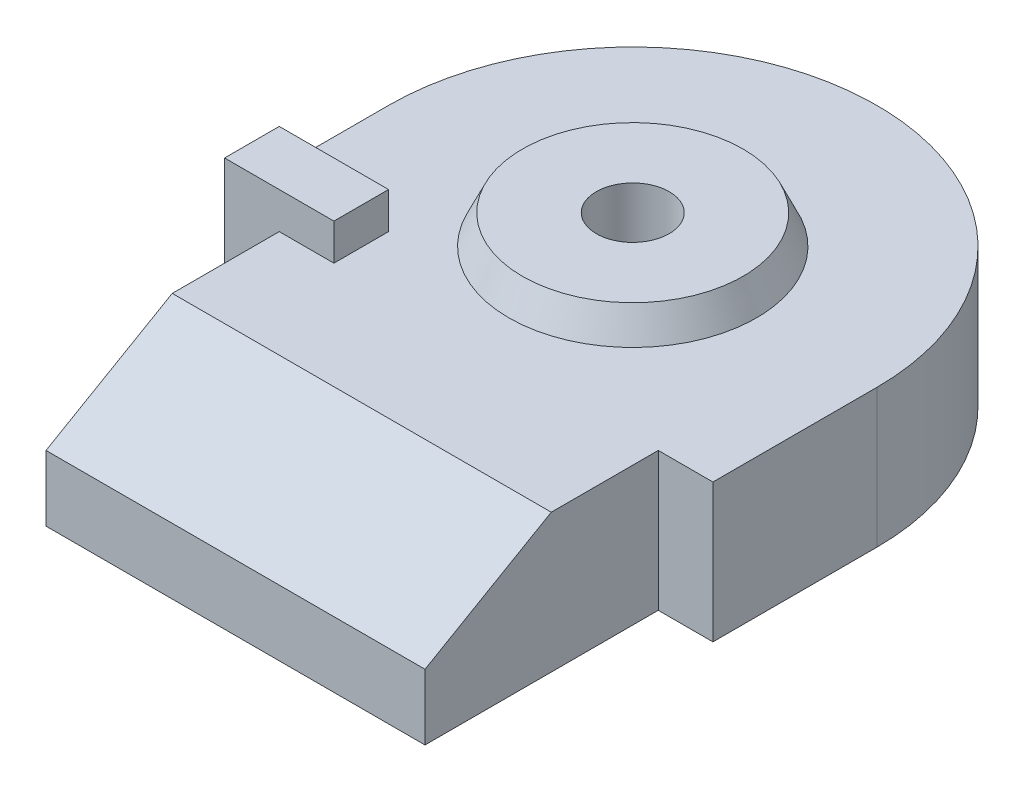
from build123d import *

# Parameters (mm, degrees)
BOSS_EXTRUDE1_DEPTH     = 190
SKETCH3_W               = 150
SKETCH3_H               = 75
BOSS_EXTRUDE2_DEPTH     = 50
SKETCH4_R               = 50
CUT_EXTRUDE2_DEPTH      = 684.264224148
CUT_EXTRUDE3_DEPTH      = 684.264224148
CUT_EXTRUDE3_DEPTH_BACK = 684.264224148


with BuildPart() as part:
    # Sketch1 → Boss-Extrude1 (new body)
    with BuildSketch(Plane(origin=(0, 0, 0), x_dir=(1, 0, 0), z_dir=(0, 1, 0))):
        with BuildLine():
            Line((-335, 0), (-335, -225))
            Line((-335, -225), (-260, -225))
            Line((-260, -225), (-260, -545))
            Line((-260, -545), (260, -545))
            Line((260, -545), (260, -225))
            Line((260, -225), (335, -225))
            Line((335, -225), (335, 0))
            ThreePointArc((335, 0), (0, 335), (-335, 0))
        make_face()
    extrude(amount=BOSS_EXTRUDE1_DEPTH)

    # Sketch3 → Boss-Extrude2 (add)
    with BuildSketch(Plane(origin=(0, 190, 0), x_dir=(1, 0, 0), z_dir=(0, 1, 0))):
        with Locations((-260, -187.5)):
            Rectangle(SKETCH3_W, SKETCH3_H)
    extrude(amount=BOSS_EXTRUDE2_DEPTH)

    # Sketch4 → Cut-Extrude2 (cut, through all)
    with BuildSketch(Plane(origin=(0, 0, 0), x_dir=(1, 0, 0), z_dir=(0, 1, 0))):
        with Locations(Location((0, 0, 0), (0, 0, 90))):
            Circle(SKETCH4_R)
    extrude(amount=CUT_EXTRUDE2_DEPTH, mode=Mode.SUBTRACT)

    # Sketch5 → Cut-Extrude3 (cut, two sides: drawn at the far end of the back side and taken through both)
    with BuildSketch(Plane(origin=(0, 0, 0), x_dir=(0, 0, -1), z_dir=(1, 0, 0)).offset(-CUT_EXTRUDE3_DEPTH_BACK)):
        Polygon((-2126.948417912, -823.338344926), (-545, 90), (-371.794919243, 190), (-371.794919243, 225.118966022), (-545, 225.118966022), (-2371.676689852, 225.118966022), (-5929.396500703, -605.315055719), (-5684.668228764, -1653.772366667), align=None)
    extrude(amount=CUT_EXTRUDE3_DEPTH + CUT_EXTRUDE3_DEPTH_BACK, mode=Mode.SUBTRACT)

    # Sketch6 → Revolve1 (revolve)
    with BuildSketch(Plane(origin=(0, 0, 0), x_dir=(0, 0, -1), z_dir=(1, 0, 0))):
        Polygon((170, 190), (151.347693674, 230), (50, 230), (50, 190), align=None)
    revolve(axis=Axis((0, 0, 0), (0, 1, 0)))


solid = part.part
